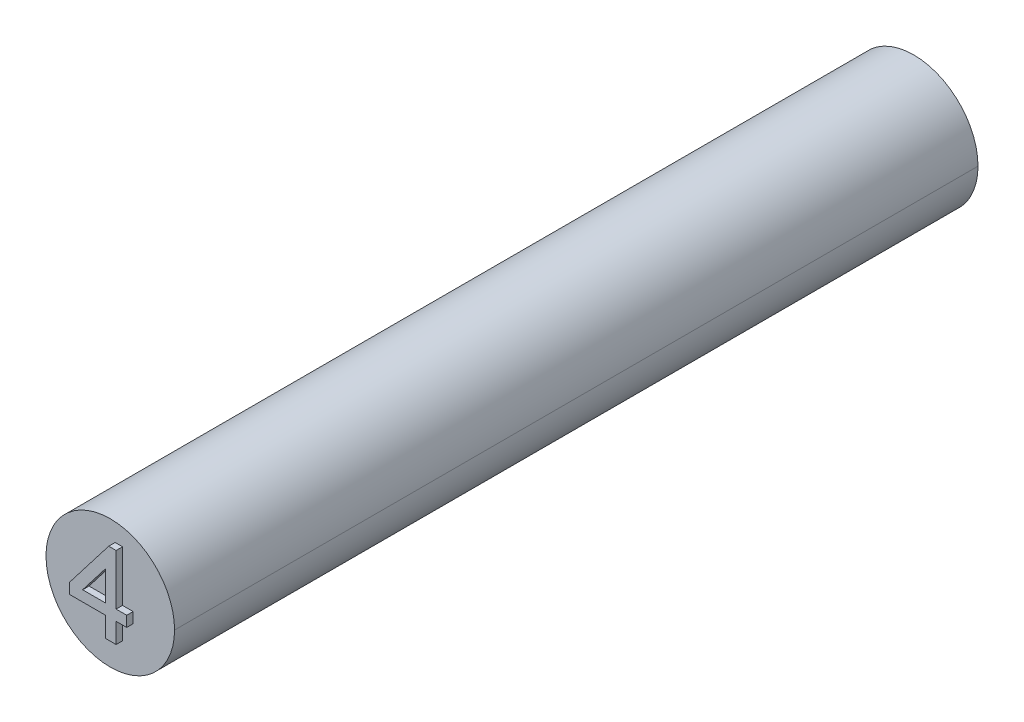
ISO-10303-21;
HEADER;
FILE_DESCRIPTION(('STEP AP214'),'2;1');
FILE_NAME('part.step','',(''),(''),'','','');
FILE_SCHEMA(('AUTOMOTIVE_DESIGN { 1 0 10303 214 1 1 1 1 }'));
ENDSEC;
DATA;
#1=APPLICATION_CONTEXT('core data for automotive mechanical design processes');
#2=APPLICATION_PROTOCOL_DEFINITION('international standard','automotive_design',2000,#1);
#3=PRODUCT_CONTEXT('',#1,'mechanical');
#4=PRODUCT('Part','Part','',(#3));
#5=PRODUCT_RELATED_PRODUCT_CATEGORY('part','',(#4));
#6=PRODUCT_DEFINITION_FORMATION('','',#4);
#7=PRODUCT_DEFINITION_CONTEXT('part definition',#1,'design');
#8=PRODUCT_DEFINITION('design','',#6,#7);
#9=PRODUCT_DEFINITION_SHAPE('','',#8);
#10=(LENGTH_UNIT() NAMED_UNIT(*) SI_UNIT(.MILLI.,.METRE.));
#11=(NAMED_UNIT(*) PLANE_ANGLE_UNIT() SI_UNIT($,.RADIAN.));
#12=(NAMED_UNIT(*) SI_UNIT($,.STERADIAN.) SOLID_ANGLE_UNIT());
#13=UNCERTAINTY_MEASURE_WITH_UNIT(LENGTH_MEASURE(1.E-05),#10,'distance_accuracy_value','');
#14=(GEOMETRIC_REPRESENTATION_CONTEXT(3) GLOBAL_UNCERTAINTY_ASSIGNED_CONTEXT((#13)) GLOBAL_UNIT_ASSIGNED_CONTEXT((#10,
#11,#12)) REPRESENTATION_CONTEXT('',''));
#15=CARTESIAN_POINT('',(0.,0.,0.));
#16=DIRECTION('',(0.,0.,1.));
#17=DIRECTION('',(1.,0.,0.));
#18=AXIS2_PLACEMENT_3D('',#15,#16,#17);
#19=CARTESIAN_POINT('',(0.,0.,0.));
#20=DIRECTION('',(0.,0.,1.));
#21=DIRECTION('',(1.,0.,0.));
#22=AXIS2_PLACEMENT_3D('',#19,#20,#21);
#23=PLANE('',#22);
#24=DIRECTION('',(1.,0.,0.));
#25=VECTOR('',#24,1.);
#26=CARTESIAN_POINT('',(-0.660628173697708,-0.14511228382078,0.));
#27=LINE('',#26,#25);
#28=CARTESIAN_POINT('',(-0.660628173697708,-0.14511228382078,0.));
#29=VERTEX_POINT('',#28);
#30=CARTESIAN_POINT('',(0.0524506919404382,-0.14511228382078,0.));
#31=VERTEX_POINT('',#30);
#32=EDGE_CURVE('E332',#29,#31,#27,.T.);
#33=ORIENTED_EDGE('',*,*,#32,.T.);
#34=DIRECTION('',(0.,1.,0.));
#35=VECTOR('',#34,1.);
#36=CARTESIAN_POINT('',(0.0524506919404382,-0.14511228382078,0.));
#37=LINE('',#36,#35);
#38=CARTESIAN_POINT('',(0.0524506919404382,0.77993519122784,0.));
#39=VERTEX_POINT('',#38);
#40=EDGE_CURVE('E41',#31,#39,#37,.T.);
#41=ORIENTED_EDGE('',*,*,#40,.T.);
#42=DIRECTION('',(-0.610519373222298,-0.792001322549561,0.));
#43=VECTOR('',#42,1.);
#44=CARTESIAN_POINT('',(0.0524506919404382,0.77993519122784,0.));
#45=LINE('',#44,#43);
#46=EDGE_CURVE('E9',#39,#29,#45,.T.);
#47=ORIENTED_EDGE('',*,*,#46,.T.);
#48=EDGE_LOOP('',(#33,#41,#47));
#49=FACE_BOUND('',#48,.T.);
#50=ADVANCED_FACE('F15',(#49),#23,.T.);
#51=CARTESIAN_POINT('',(0.0524506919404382,0.77993519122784,0.2));
#52=DIRECTION('',(0.792001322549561,-0.610519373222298,0.));
#53=DIRECTION('',(0.,0.,-1.));
#54=AXIS2_PLACEMENT_3D('',#51,#52,#53);
#55=PLANE('',#54);
#56=ORIENTED_EDGE('',*,*,#46,.F.);
#57=DIRECTION('',(0.,0.,-1.));
#58=VECTOR('',#57,1.);
#59=CARTESIAN_POINT('',(0.0524506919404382,0.77993519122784,0.2));
#60=LINE('',#59,#58);
#61=CARTESIAN_POINT('',(0.0524506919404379,0.77993519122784,0.2));
#62=VERTEX_POINT('',#61);
#63=EDGE_CURVE('E23',#62,#39,#60,.T.);
#64=ORIENTED_EDGE('',*,*,#63,.F.);
#65=DIRECTION('',(-0.610519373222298,-0.792001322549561,0.));
#66=VECTOR('',#65,1.);
#67=CARTESIAN_POINT('',(0.0524506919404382,0.77993519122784,0.2));
#68=LINE('',#67,#66);
#69=CARTESIAN_POINT('',(-0.660628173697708,-0.14511228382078,0.2));
#70=VERTEX_POINT('',#69);
#71=EDGE_CURVE('E301',#62,#70,#68,.T.);
#72=ORIENTED_EDGE('',*,*,#71,.T.);
#73=DIRECTION('',(0.,0.,-1.));
#74=VECTOR('',#73,1.);
#75=CARTESIAN_POINT('',(-0.660628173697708,-0.14511228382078,0.2));
#76=LINE('',#75,#74);
#77=EDGE_CURVE('E336',#70,#29,#76,.T.);
#78=ORIENTED_EDGE('',*,*,#77,.T.);
#79=EDGE_LOOP('',(#56,#64,#72,#78));
#80=FACE_BOUND('',#79,.T.);
#81=ADVANCED_FACE('F346',(#80),#55,.T.);
#82=CARTESIAN_POINT('',(0.0524506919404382,-0.14511228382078,0.2));
#83=DIRECTION('',(-1.,0.,0.));
#84=DIRECTION('',(0.,0.,1.));
#85=AXIS2_PLACEMENT_3D('',#82,#83,#84);
#86=PLANE('',#85);
#87=ORIENTED_EDGE('',*,*,#40,.F.);
#88=DIRECTION('',(0.,0.,-1.));
#89=VECTOR('',#88,1.);
#90=CARTESIAN_POINT('',(0.0524506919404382,-0.14511228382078,0.2));
#91=LINE('',#90,#89);
#92=CARTESIAN_POINT('',(0.0524506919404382,-0.14511228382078,0.2));
#93=VERTEX_POINT('',#92);
#94=EDGE_CURVE('E253',#93,#31,#91,.T.);
#95=ORIENTED_EDGE('',*,*,#94,.F.);
#96=DIRECTION('',(0.,1.,0.));
#97=VECTOR('',#96,1.);
#98=CARTESIAN_POINT('',(0.0524506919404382,-0.14511228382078,0.2));
#99=LINE('',#98,#97);
#100=EDGE_CURVE('E305',#93,#62,#99,.T.);
#101=ORIENTED_EDGE('',*,*,#100,.T.);
#102=ORIENTED_EDGE('',*,*,#63,.T.);
#103=EDGE_LOOP('',(#87,#95,#101,#102));
#104=FACE_BOUND('',#103,.T.);
#105=ADVANCED_FACE('F351',(#104),#86,.T.);
#106=CARTESIAN_POINT('',(-0.660628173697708,-0.14511228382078,0.2));
#107=DIRECTION('',(0.,1.,0.));
#108=DIRECTION('',(1.,0.,0.));
#109=AXIS2_PLACEMENT_3D('',#106,#107,#108);
#110=PLANE('',#109);
#111=ORIENTED_EDGE('',*,*,#32,.F.);
#112=ORIENTED_EDGE('',*,*,#77,.F.);
#113=DIRECTION('',(1.,0.,0.));
#114=VECTOR('',#113,1.);
#115=CARTESIAN_POINT('',(-0.660628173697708,-0.14511228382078,0.2));
#116=LINE('',#115,#114);
#117=EDGE_CURVE('E297',#70,#93,#116,.T.);
#118=ORIENTED_EDGE('',*,*,#117,.T.);
#119=ORIENTED_EDGE('',*,*,#94,.T.);
#120=EDGE_LOOP('',(#111,#112,#118,#119));
#121=FACE_BOUND('',#120,.T.);
#122=ADVANCED_FACE('F342',(#121),#110,.T.);
#123=CARTESIAN_POINT('',(0.0524506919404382,-1.1,0.2));
#124=DIRECTION('',(-1.,0.,0.));
#125=DIRECTION('',(0.,0.,1.));
#126=AXIS2_PLACEMENT_3D('',#123,#124,#125);
#127=PLANE('',#126);
#128=DIRECTION('',(0.,1.,0.));
#129=VECTOR('',#128,1.);
#130=CARTESIAN_POINT('',(0.0524506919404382,-1.1,0.));
#131=LINE('',#130,#129);
#132=CARTESIAN_POINT('',(0.0524506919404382,-1.1,0.));
#133=VERTEX_POINT('',#132);
#134=CARTESIAN_POINT('',(0.0524506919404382,-0.474383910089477,0.));
#135=VERTEX_POINT('',#134);
#136=EDGE_CURVE('E205',#133,#135,#131,.T.);
#137=ORIENTED_EDGE('',*,*,#136,.F.);
#138=DIRECTION('',(0.,0.,-1.));
#139=VECTOR('',#138,1.);
#140=CARTESIAN_POINT('',(0.0524506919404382,-1.1,0.2));
#141=LINE('',#140,#139);
#142=CARTESIAN_POINT('',(0.0524506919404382,-1.1,0.2));
#143=VERTEX_POINT('',#142);
#144=EDGE_CURVE('E192',#143,#133,#141,.T.);
#145=ORIENTED_EDGE('',*,*,#144,.F.);
#146=DIRECTION('',(0.,1.,0.));
#147=VECTOR('',#146,1.);
#148=CARTESIAN_POINT('',(0.0524506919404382,-1.1,0.2));
#149=LINE('',#148,#147);
#150=CARTESIAN_POINT('',(0.0524506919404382,-0.474383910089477,0.2));
#151=VERTEX_POINT('',#150);
#152=EDGE_CURVE('E293',#143,#151,#149,.T.);
#153=ORIENTED_EDGE('',*,*,#152,.T.);
#154=DIRECTION('',(0.,0.,-1.));
#155=VECTOR('',#154,1.);
#156=CARTESIAN_POINT('',(0.0524506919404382,-0.474383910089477,0.2));
#157=LINE('',#156,#155);
#158=EDGE_CURVE('E329',#151,#135,#157,.T.);
#159=ORIENTED_EDGE('',*,*,#158,.T.);
#160=EDGE_LOOP('',(#137,#145,#153,#159));
#161=FACE_BOUND('',#160,.T.);
#162=ADVANCED_FACE('F359',(#161),#127,.T.);
#163=CARTESIAN_POINT('',(0.0524506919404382,-0.474383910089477,0.2));
#164=DIRECTION('',(0.,-1.,0.));
#165=DIRECTION('',(0.,0.,-1.));
#166=AXIS2_PLACEMENT_3D('',#163,#164,#165);
#167=PLANE('',#166);
#168=DIRECTION('',(-1.,0.,0.));
#169=VECTOR('',#168,1.);
#170=CARTESIAN_POINT('',(0.0524506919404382,-0.474383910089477,0.));
#171=LINE('',#170,#169);
#172=CARTESIAN_POINT('',(-1.06707283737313,-0.474383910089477,0.));
#173=VERTEX_POINT('',#172);
#174=EDGE_CURVE('E220',#135,#173,#171,.T.);
#175=ORIENTED_EDGE('',*,*,#174,.F.);
#176=ORIENTED_EDGE('',*,*,#158,.F.);
#177=DIRECTION('',(-1.,0.,0.));
#178=VECTOR('',#177,1.);
#179=CARTESIAN_POINT('',(0.0524506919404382,-0.474383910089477,0.2));
#180=LINE('',#179,#178);
#181=CARTESIAN_POINT('',(-1.06707283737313,-0.474383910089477,0.2));
#182=VERTEX_POINT('',#181);
#183=EDGE_CURVE('E289',#151,#182,#180,.T.);
#184=ORIENTED_EDGE('',*,*,#183,.T.);
#185=DIRECTION('',(0.,0.,-1.));
#186=VECTOR('',#185,1.);
#187=CARTESIAN_POINT('',(-1.06707283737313,-0.474383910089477,0.2));
#188=LINE('',#187,#186);
#189=EDGE_CURVE('E326',#182,#173,#188,.T.);
#190=ORIENTED_EDGE('',*,*,#189,.T.);
#191=EDGE_LOOP('',(#175,#176,#184,#190));
#192=FACE_BOUND('',#191,.T.);
#193=ADVANCED_FACE('F395',(#192),#167,.T.);
#194=CARTESIAN_POINT('',(-1.06707283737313,-0.474383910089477,0.2));
#195=DIRECTION('',(-1.,0.,0.));
#196=DIRECTION('',(0.,0.,1.));
#197=AXIS2_PLACEMENT_3D('',#194,#195,#196);
#198=PLANE('',#197);
#199=DIRECTION('',(0.,1.,0.));
#200=VECTOR('',#199,1.);
#201=CARTESIAN_POINT('',(-1.06707283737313,-0.474383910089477,0.));
#202=LINE('',#201,#200);
#203=CARTESIAN_POINT('',(-1.06707283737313,-0.14511228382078,0.));
#204=VERTEX_POINT('',#203);
#205=EDGE_CURVE('E233',#173,#204,#202,.T.);
#206=ORIENTED_EDGE('',*,*,#205,.F.);
#207=ORIENTED_EDGE('',*,*,#189,.F.);
#208=DIRECTION('',(0.,1.,0.));
#209=VECTOR('',#208,1.);
#210=CARTESIAN_POINT('',(-1.06707283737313,-0.474383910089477,0.2));
#211=LINE('',#210,#209);
#212=CARTESIAN_POINT('',(-1.06707283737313,-0.14511228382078,0.2));
#213=VERTEX_POINT('',#212);
#214=EDGE_CURVE('E285',#182,#213,#211,.T.);
#215=ORIENTED_EDGE('',*,*,#214,.T.);
#216=DIRECTION('',(0.,0.,-1.));
#217=VECTOR('',#216,1.);
#218=CARTESIAN_POINT('',(-1.06707283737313,-0.14511228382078,0.2));
#219=LINE('',#218,#217);
#220=EDGE_CURVE('E246',#213,#204,#219,.T.);
#221=ORIENTED_EDGE('',*,*,#220,.T.);
#222=EDGE_LOOP('',(#206,#207,#215,#221));
#223=FACE_BOUND('',#222,.T.);
#224=ADVANCED_FACE('F406',(#223),#198,.T.);
#225=CARTESIAN_POINT('',(-1.06707283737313,-0.14511228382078,0.2));
#226=DIRECTION('',(-0.792010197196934,0.610507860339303,0.));
#227=DIRECTION('',(0.,0.,1.));
#228=AXIS2_PLACEMENT_3D('',#225,#226,#227);
#229=PLANE('',#228);
#230=DIRECTION('',(0.610507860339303,0.792010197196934,0.));
#231=VECTOR('',#230,1.);
#232=CARTESIAN_POINT('',(-1.06707283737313,-0.14511228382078,0.));
#233=LINE('',#232,#231);
#234=CARTESIAN_POINT('',(0.151232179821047,1.43539152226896,0.));
#235=VERTEX_POINT('',#234);
#236=EDGE_CURVE('E216',#204,#235,#233,.T.);
#237=ORIENTED_EDGE('',*,*,#236,.F.);
#238=ORIENTED_EDGE('',*,*,#220,.F.);
#239=DIRECTION('',(0.610507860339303,0.792010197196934,0.));
#240=VECTOR('',#239,1.);
#241=CARTESIAN_POINT('',(-1.06707283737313,-0.14511228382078,0.2));
#242=LINE('',#241,#240);
#243=CARTESIAN_POINT('',(0.151232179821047,1.43539152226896,0.2));
#244=VERTEX_POINT('',#243);
#245=EDGE_CURVE('E281',#213,#244,#242,.T.);
#246=ORIENTED_EDGE('',*,*,#245,.T.);
#247=DIRECTION('',(0.,0.,-1.));
#248=VECTOR('',#247,1.);
#249=CARTESIAN_POINT('',(0.151232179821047,1.43539152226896,0.2));
#250=LINE('',#249,#248);
#251=EDGE_CURVE('E243',#244,#235,#250,.T.);
#252=ORIENTED_EDGE('',*,*,#251,.T.);
#253=EDGE_LOOP('',(#237,#238,#246,#252));
#254=FACE_BOUND('',#253,.T.);
#255=ADVANCED_FACE('F417',(#254),#229,.T.);
#256=CARTESIAN_POINT('',(0.151232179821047,1.43539152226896,0.2));
#257=DIRECTION('',(0.,1.,0.));
#258=DIRECTION('',(1.,0.,0.));
#259=AXIS2_PLACEMENT_3D('',#256,#257,#258);
#260=PLANE('',#259);
#261=DIRECTION('',(1.,0.,0.));
#262=VECTOR('',#261,1.);
#263=CARTESIAN_POINT('',(0.151232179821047,1.43539152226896,0.));
#264=LINE('',#263,#262);
#265=CARTESIAN_POINT('',(0.381722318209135,1.43539152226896,0.));
#266=VERTEX_POINT('',#265);
#267=EDGE_CURVE('E211',#235,#266,#264,.T.);
#268=ORIENTED_EDGE('',*,*,#267,.F.);
#269=ORIENTED_EDGE('',*,*,#251,.F.);
#270=DIRECTION('',(1.,0.,0.));
#271=VECTOR('',#270,1.);
#272=CARTESIAN_POINT('',(0.151232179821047,1.43539152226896,0.2));
#273=LINE('',#272,#271);
#274=CARTESIAN_POINT('',(0.381722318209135,1.43539152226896,0.2));
#275=VERTEX_POINT('',#274);
#276=EDGE_CURVE('E277',#244,#275,#273,.T.);
#277=ORIENTED_EDGE('',*,*,#276,.T.);
#278=DIRECTION('',(0.,0.,-1.));
#279=VECTOR('',#278,1.);
#280=CARTESIAN_POINT('',(0.381722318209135,1.43539152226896,0.2));
#281=LINE('',#280,#279);
#282=EDGE_CURVE('E247',#275,#266,#281,.T.);
#283=ORIENTED_EDGE('',*,*,#282,.T.);
#284=EDGE_LOOP('',(#268,#269,#277,#283));
#285=FACE_BOUND('',#284,.T.);
#286=ADVANCED_FACE('F428',(#285),#260,.T.);
#287=CARTESIAN_POINT('',(0.381722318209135,1.43539152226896,0.2));
#288=DIRECTION('',(1.,0.,0.));
#289=DIRECTION('',(0.,1.,0.));
#290=AXIS2_PLACEMENT_3D('',#287,#288,#289);
#291=PLANE('',#290);
#292=DIRECTION('',(0.,-1.,0.));
#293=VECTOR('',#292,1.);
#294=CARTESIAN_POINT('',(0.381722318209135,1.43539152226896,0.));
#295=LINE('',#294,#293);
#296=CARTESIAN_POINT('',(0.381722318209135,-0.14511228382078,0.));
#297=VERTEX_POINT('',#296);
#298=EDGE_CURVE('E215',#266,#297,#295,.T.);
#299=ORIENTED_EDGE('',*,*,#298,.F.);
#300=ORIENTED_EDGE('',*,*,#282,.F.);
#301=DIRECTION('',(0.,-1.,0.));
#302=VECTOR('',#301,1.);
#303=CARTESIAN_POINT('',(0.381722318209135,1.43539152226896,0.2));
#304=LINE('',#303,#302);
#305=CARTESIAN_POINT('',(0.381722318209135,-0.14511228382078,0.2));
#306=VERTEX_POINT('',#305);
#307=EDGE_CURVE('E273',#275,#306,#304,.T.);
#308=ORIENTED_EDGE('',*,*,#307,.T.);
#309=DIRECTION('',(0.,0.,-1.));
#310=VECTOR('',#309,1.);
#311=CARTESIAN_POINT('',(0.381722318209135,-0.14511228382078,0.2));
#312=LINE('',#311,#310);
#313=EDGE_CURVE('E319',#306,#297,#312,.T.);
#314=ORIENTED_EDGE('',*,*,#313,.T.);
#315=EDGE_LOOP('',(#299,#300,#308,#314));
#316=FACE_BOUND('',#315,.T.);
#317=ADVANCED_FACE('F439',(#316),#291,.T.);
#318=CARTESIAN_POINT('',(0.381722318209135,-0.14511228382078,0.2));
#319=DIRECTION('',(0.,1.,0.));
#320=DIRECTION('',(1.,0.,0.));
#321=AXIS2_PLACEMENT_3D('',#318,#319,#320);
#322=PLANE('',#321);
#323=DIRECTION('',(1.,0.,0.));
#324=VECTOR('',#323,1.);
#325=CARTESIAN_POINT('',(0.381722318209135,-0.14511228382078,0.));
#326=LINE('',#325,#324);
#327=CARTESIAN_POINT('',(0.710993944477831,-0.14511228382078,0.));
#328=VERTEX_POINT('',#327);
#329=EDGE_CURVE('E229',#297,#328,#326,.T.);
#330=ORIENTED_EDGE('',*,*,#329,.F.);
#331=ORIENTED_EDGE('',*,*,#313,.F.);
#332=DIRECTION('',(1.,0.,0.));
#333=VECTOR('',#332,1.);
#334=CARTESIAN_POINT('',(0.381722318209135,-0.14511228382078,0.2));
#335=LINE('',#334,#333);
#336=CARTESIAN_POINT('',(0.710993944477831,-0.14511228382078,0.2));
#337=VERTEX_POINT('',#336);
#338=EDGE_CURVE('E269',#306,#337,#335,.T.);
#339=ORIENTED_EDGE('',*,*,#338,.T.);
#340=DIRECTION('',(0.,0.,-1.));
#341=VECTOR('',#340,1.);
#342=CARTESIAN_POINT('',(0.710993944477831,-0.14511228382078,0.2));
#343=LINE('',#342,#341);
#344=EDGE_CURVE('E316',#337,#328,#343,.T.);
#345=ORIENTED_EDGE('',*,*,#344,.T.);
#346=EDGE_LOOP('',(#330,#331,#339,#345));
#347=FACE_BOUND('',#346,.T.);
#348=ADVANCED_FACE('F450',(#347),#322,.T.);
#349=CARTESIAN_POINT('',(0.710993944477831,-0.14511228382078,0.2));
#350=DIRECTION('',(1.,0.,0.));
#351=DIRECTION('',(0.,1.,0.));
#352=AXIS2_PLACEMENT_3D('',#349,#350,#351);
#353=PLANE('',#352);
#354=DIRECTION('',(0.,-1.,0.));
#355=VECTOR('',#354,1.);
#356=CARTESIAN_POINT('',(0.710993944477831,-0.14511228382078,0.));
#357=LINE('',#356,#355);
#358=CARTESIAN_POINT('',(0.710993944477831,-0.474383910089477,0.));
#359=VERTEX_POINT('',#358);
#360=EDGE_CURVE('E210',#328,#359,#357,.T.);
#361=ORIENTED_EDGE('',*,*,#360,.F.);
#362=ORIENTED_EDGE('',*,*,#344,.F.);
#363=DIRECTION('',(0.,-1.,0.));
#364=VECTOR('',#363,1.);
#365=CARTESIAN_POINT('',(0.710993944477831,-0.14511228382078,0.2));
#366=LINE('',#365,#364);
#367=CARTESIAN_POINT('',(0.710993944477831,-0.474383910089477,0.2));
#368=VERTEX_POINT('',#367);
#369=EDGE_CURVE('E265',#337,#368,#366,.T.);
#370=ORIENTED_EDGE('',*,*,#369,.T.);
#371=DIRECTION('',(0.,0.,-1.));
#372=VECTOR('',#371,1.);
#373=CARTESIAN_POINT('',(0.710993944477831,-0.474383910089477,0.2));
#374=LINE('',#373,#372);
#375=EDGE_CURVE('E313',#368,#359,#374,.T.);
#376=ORIENTED_EDGE('',*,*,#375,.T.);
#377=EDGE_LOOP('',(#361,#362,#370,#376));
#378=FACE_BOUND('',#377,.T.);
#379=ADVANCED_FACE('F461',(#378),#353,.T.);
#380=CARTESIAN_POINT('',(0.710993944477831,-0.474383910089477,0.2));
#381=DIRECTION('',(0.,-1.,0.));
#382=DIRECTION('',(0.,0.,-1.));
#383=AXIS2_PLACEMENT_3D('',#380,#381,#382);
#384=PLANE('',#383);
#385=DIRECTION('',(-1.,0.,0.));
#386=VECTOR('',#385,1.);
#387=CARTESIAN_POINT('',(0.710993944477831,-0.474383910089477,0.));
#388=LINE('',#387,#386);
#389=CARTESIAN_POINT('',(0.381722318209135,-0.474383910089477,0.));
#390=VERTEX_POINT('',#389);
#391=EDGE_CURVE('E206',#359,#390,#388,.T.);
#392=ORIENTED_EDGE('',*,*,#391,.F.);
#393=ORIENTED_EDGE('',*,*,#375,.F.);
#394=DIRECTION('',(-1.,0.,0.));
#395=VECTOR('',#394,1.);
#396=CARTESIAN_POINT('',(0.710993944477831,-0.474383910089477,0.2));
#397=LINE('',#396,#395);
#398=CARTESIAN_POINT('',(0.381722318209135,-0.474383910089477,0.2));
#399=VERTEX_POINT('',#398);
#400=EDGE_CURVE('E261',#368,#399,#397,.T.);
#401=ORIENTED_EDGE('',*,*,#400,.T.);
#402=DIRECTION('',(0.,0.,-1.));
#403=VECTOR('',#402,1.);
#404=CARTESIAN_POINT('',(0.381722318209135,-0.474383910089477,0.2));
#405=LINE('',#404,#403);
#406=EDGE_CURVE('E195',#399,#390,#405,.T.);
#407=ORIENTED_EDGE('',*,*,#406,.T.);
#408=EDGE_LOOP('',(#392,#393,#401,#407));
#409=FACE_BOUND('',#408,.T.);
#410=ADVANCED_FACE('F472',(#409),#384,.T.);
#411=CARTESIAN_POINT('',(0.381722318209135,-0.474383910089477,0.2));
#412=DIRECTION('',(1.,0.,0.));
#413=DIRECTION('',(0.,1.,0.));
#414=AXIS2_PLACEMENT_3D('',#411,#412,#413);
#415=PLANE('',#414);
#416=DIRECTION('',(0.,-1.,0.));
#417=VECTOR('',#416,1.);
#418=CARTESIAN_POINT('',(0.381722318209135,-0.474383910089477,0.));
#419=LINE('',#418,#417);
#420=CARTESIAN_POINT('',(0.381722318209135,-1.1,0.));
#421=VERTEX_POINT('',#420);
#422=EDGE_CURVE('E175',#390,#421,#419,.T.);
#423=ORIENTED_EDGE('',*,*,#422,.F.);
#424=ORIENTED_EDGE('',*,*,#406,.F.);
#425=DIRECTION('',(0.,-1.,0.));
#426=VECTOR('',#425,1.);
#427=CARTESIAN_POINT('',(0.381722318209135,-0.474383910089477,0.2));
#428=LINE('',#427,#426);
#429=CARTESIAN_POINT('',(0.381722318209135,-1.1,0.2));
#430=VERTEX_POINT('',#429);
#431=EDGE_CURVE('E257',#399,#430,#428,.T.);
#432=ORIENTED_EDGE('',*,*,#431,.T.);
#433=DIRECTION('',(0.,0.,-1.));
#434=VECTOR('',#433,1.);
#435=CARTESIAN_POINT('',(0.381722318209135,-1.1,0.2));
#436=LINE('',#435,#434);
#437=EDGE_CURVE('E196',#430,#421,#436,.T.);
#438=ORIENTED_EDGE('',*,*,#437,.T.);
#439=EDGE_LOOP('',(#423,#424,#432,#438));
#440=FACE_BOUND('',#439,.T.);
#441=ADVANCED_FACE('F483',(#440),#415,.T.);
#442=CARTESIAN_POINT('',(0.381722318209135,-1.1,0.2));
#443=DIRECTION('',(0.,-1.,0.));
#444=DIRECTION('',(0.,0.,-1.));
#445=AXIS2_PLACEMENT_3D('',#442,#443,#444);
#446=PLANE('',#445);
#447=DIRECTION('',(-1.,0.,0.));
#448=VECTOR('',#447,1.);
#449=CARTESIAN_POINT('',(0.381722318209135,-1.1,0.));
#450=LINE('',#449,#448);
#451=EDGE_CURVE('E201',#421,#133,#450,.T.);
#452=ORIENTED_EDGE('',*,*,#451,.F.);
#453=ORIENTED_EDGE('',*,*,#437,.F.);
#454=DIRECTION('',(-1.,0.,0.));
#455=VECTOR('',#454,1.);
#456=CARTESIAN_POINT('',(0.381722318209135,-1.1,0.2));
#457=LINE('',#456,#455);
#458=EDGE_CURVE('E174',#430,#143,#457,.T.);
#459=ORIENTED_EDGE('',*,*,#458,.T.);
#460=ORIENTED_EDGE('',*,*,#144,.T.);
#461=EDGE_LOOP('',(#452,#453,#459,#460));
#462=FACE_BOUND('',#461,.T.);
#463=ADVANCED_FACE('F494',(#462),#446,.T.);
#464=CARTESIAN_POINT('',(0.0524506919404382,-1.1,0.2));
#465=DIRECTION('',(0.,0.,-1.));
#466=DIRECTION('',(0.,-1.,0.));
#467=AXIS2_PLACEMENT_3D('',#464,#465,#466);
#468=PLANE('',#467);
#469=ORIENTED_EDGE('',*,*,#117,.F.);
#470=ORIENTED_EDGE('',*,*,#71,.F.);
#471=ORIENTED_EDGE('',*,*,#100,.F.);
#472=EDGE_LOOP('',(#469,#470,#471));
#473=FACE_BOUND('',#472,.T.);
#474=ORIENTED_EDGE('',*,*,#458,.F.);
#475=ORIENTED_EDGE('',*,*,#431,.F.);
#476=ORIENTED_EDGE('',*,*,#400,.F.);
#477=ORIENTED_EDGE('',*,*,#369,.F.);
#478=ORIENTED_EDGE('',*,*,#338,.F.);
#479=ORIENTED_EDGE('',*,*,#307,.F.);
#480=ORIENTED_EDGE('',*,*,#276,.F.);
#481=ORIENTED_EDGE('',*,*,#245,.F.);
#482=ORIENTED_EDGE('',*,*,#214,.F.);
#483=ORIENTED_EDGE('',*,*,#183,.F.);
#484=ORIENTED_EDGE('',*,*,#152,.F.);
#485=EDGE_LOOP('',(#474,#475,#476,#477,#478,#479,#480,#481,#482,#483,#484));
#486=FACE_BOUND('',#485,.T.);
#487=ADVANCED_FACE('F349',(#473,#486),#468,.F.);
#488=CARTESIAN_POINT('',(0.,0.,-25.));
#489=DIRECTION('',(0.,0.,1.));
#490=DIRECTION('',(1.,0.,0.));
#491=AXIS2_PLACEMENT_3D('',#488,#489,#490);
#492=PLANE('',#491);
#493=CARTESIAN_POINT('',(0.,0.,-25.));
#494=DIRECTION('',(0.,0.,1.));
#495=DIRECTION('',(1.,0.,0.));
#496=AXIS2_PLACEMENT_3D('',#493,#494,#495);
#497=CIRCLE('',#496,2.);
#498=CARTESIAN_POINT('',(2.,0.,-25.));
#499=VERTEX_POINT('',#498);
#500=CARTESIAN_POINT('',(-2.,0.,-25.));
#501=VERTEX_POINT('',#500);
#502=EDGE_CURVE('E179',#499,#501,#497,.T.);
#503=ORIENTED_EDGE('',*,*,#502,.F.);
#504=CARTESIAN_POINT('',(0.,0.,-25.));
#505=DIRECTION('',(0.,0.,1.));
#506=DIRECTION('',(1.,0.,0.));
#507=AXIS2_PLACEMENT_3D('',#504,#505,#506);
#508=CIRCLE('',#507,2.);
#509=EDGE_CURVE('E163',#501,#499,#508,.T.);
#510=ORIENTED_EDGE('',*,*,#509,.F.);
#511=EDGE_LOOP('',(#503,#510));
#512=FACE_BOUND('',#511,.T.);
#513=ADVANCED_FACE('F185',(#512),#492,.F.);
#514=CARTESIAN_POINT('',(0.,0.,-25.));
#515=DIRECTION('',(0.,0.,1.));
#516=DIRECTION('',(1.,0.,0.));
#517=AXIS2_PLACEMENT_3D('',#514,#515,#516);
#518=CYLINDRICAL_SURFACE('',#517,2.);
#519=DIRECTION('',(0.,0.,1.));
#520=VECTOR('',#519,1.);
#521=CARTESIAN_POINT('',(-2.,0.,-25.));
#522=LINE('',#521,#520);
#523=CARTESIAN_POINT('',(-2.,0.,0.));
#524=VERTEX_POINT('',#523);
#525=EDGE_CURVE('E169',#501,#524,#522,.T.);
#526=ORIENTED_EDGE('',*,*,#525,.F.);
#527=ORIENTED_EDGE('',*,*,#509,.T.);
#528=DIRECTION('',(0.,0.,1.));
#529=VECTOR('',#528,1.);
#530=CARTESIAN_POINT('',(2.,0.,-25.));
#531=LINE('',#530,#529);
#532=CARTESIAN_POINT('',(2.,0.,0.));
#533=VERTEX_POINT('',#532);
#534=EDGE_CURVE('E166',#499,#533,#531,.T.);
#535=ORIENTED_EDGE('',*,*,#534,.T.);
#536=CARTESIAN_POINT('',(0.,0.,0.));
#537=DIRECTION('',(0.,0.,1.));
#538=DIRECTION('',(1.,0.,0.));
#539=AXIS2_PLACEMENT_3D('',#536,#537,#538);
#540=CIRCLE('',#539,2.);
#541=EDGE_CURVE('E183',#524,#533,#540,.T.);
#542=ORIENTED_EDGE('',*,*,#541,.F.);
#543=EDGE_LOOP('',(#526,#527,#535,#542));
#544=FACE_BOUND('',#543,.T.);
#545=ADVANCED_FACE('F165',(#544),#518,.T.);
#546=CARTESIAN_POINT('',(0.,0.,0.));
#547=DIRECTION('',(0.,0.,1.));
#548=DIRECTION('',(1.,0.,0.));
#549=AXIS2_PLACEMENT_3D('',#546,#547,#548);
#550=PLANE('',#549);
#551=ORIENTED_EDGE('',*,*,#451,.T.);
#552=ORIENTED_EDGE('',*,*,#136,.T.);
#553=ORIENTED_EDGE('',*,*,#174,.T.);
#554=ORIENTED_EDGE('',*,*,#205,.T.);
#555=ORIENTED_EDGE('',*,*,#236,.T.);
#556=ORIENTED_EDGE('',*,*,#267,.T.);
#557=ORIENTED_EDGE('',*,*,#298,.T.);
#558=ORIENTED_EDGE('',*,*,#329,.T.);
#559=ORIENTED_EDGE('',*,*,#360,.T.);
#560=ORIENTED_EDGE('',*,*,#391,.T.);
#561=ORIENTED_EDGE('',*,*,#422,.T.);
#562=EDGE_LOOP('',(#551,#552,#553,#554,#555,#556,#557,#558,#559,#560,#561));
#563=FACE_BOUND('',#562,.T.);
#564=CARTESIAN_POINT('',(0.,0.,0.));
#565=DIRECTION('',(0.,0.,1.));
#566=DIRECTION('',(1.,0.,0.));
#567=AXIS2_PLACEMENT_3D('',#564,#565,#566);
#568=CIRCLE('',#567,2.);
#569=EDGE_CURVE('E181',#533,#524,#568,.T.);
#570=ORIENTED_EDGE('',*,*,#569,.T.);
#571=ORIENTED_EDGE('',*,*,#541,.T.);
#572=EDGE_LOOP('',(#570,#571));
#573=FACE_BOUND('',#572,.T.);
#574=ADVANCED_FACE('F533',(#563,#573),#550,.T.);
#575=CARTESIAN_POINT('',(0.,0.,-25.));
#576=DIRECTION('',(0.,0.,1.));
#577=DIRECTION('',(1.,0.,0.));
#578=AXIS2_PLACEMENT_3D('',#575,#576,#577);
#579=CYLINDRICAL_SURFACE('',#578,2.);
#580=ORIENTED_EDGE('',*,*,#502,.T.);
#581=ORIENTED_EDGE('',*,*,#525,.T.);
#582=ORIENTED_EDGE('',*,*,#569,.F.);
#583=ORIENTED_EDGE('',*,*,#534,.F.);
#584=EDGE_LOOP('',(#580,#581,#582,#583));
#585=FACE_BOUND('',#584,.T.);
#586=ADVANCED_FACE('F178',(#585),#579,.T.);
#587=CLOSED_SHELL('',(#50,#81,#105,#122,#162,#193,#224,#255,#286,#317,#348,#379,#410,#441,#463,
#487,#513,#545,#574,#586));
#588=MANIFOLD_SOLID_BREP('B1',#587);
#589=ADVANCED_BREP_SHAPE_REPRESENTATION('',(#18,#588),#14);
#590=SHAPE_DEFINITION_REPRESENTATION(#9,#589);
ENDSEC;
END-ISO-10303-21;
